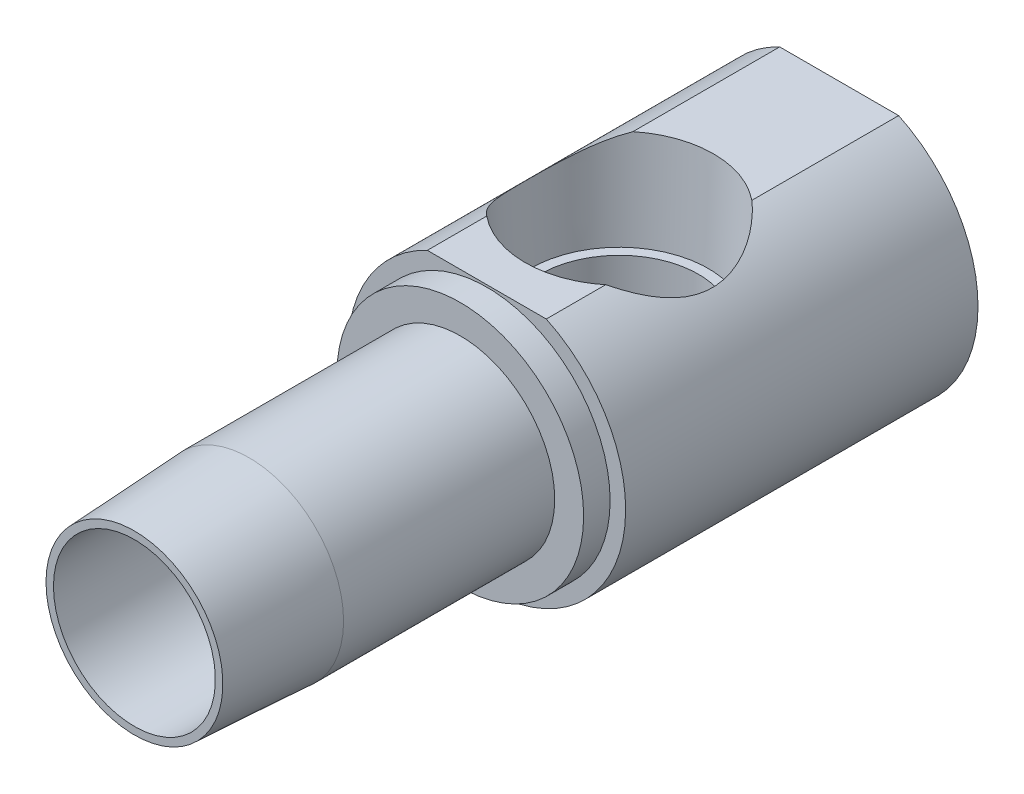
ISO-10303-21;
HEADER;
FILE_DESCRIPTION(('STEP AP214'),'2;1');
FILE_NAME('part.step','',(''),(''),'','','');
FILE_SCHEMA(('AUTOMOTIVE_DESIGN { 1 0 10303 214 1 1 1 1 }'));
ENDSEC;
DATA;
#1=APPLICATION_CONTEXT('core data for automotive mechanical design processes');
#2=APPLICATION_PROTOCOL_DEFINITION('international standard','automotive_design',2000,#1);
#3=PRODUCT_CONTEXT('',#1,'mechanical');
#4=PRODUCT('Part','Part','',(#3));
#5=PRODUCT_RELATED_PRODUCT_CATEGORY('part','',(#4));
#6=PRODUCT_DEFINITION_FORMATION('','',#4);
#7=PRODUCT_DEFINITION_CONTEXT('part definition',#1,'design');
#8=PRODUCT_DEFINITION('design','',#6,#7);
#9=PRODUCT_DEFINITION_SHAPE('','',#8);
#10=(LENGTH_UNIT() NAMED_UNIT(*) SI_UNIT(.MILLI.,.METRE.));
#11=(NAMED_UNIT(*) PLANE_ANGLE_UNIT() SI_UNIT($,.RADIAN.));
#12=(NAMED_UNIT(*) SI_UNIT($,.STERADIAN.) SOLID_ANGLE_UNIT());
#13=UNCERTAINTY_MEASURE_WITH_UNIT(LENGTH_MEASURE(1.E-05),#10,'distance_accuracy_value','');
#14=(GEOMETRIC_REPRESENTATION_CONTEXT(3) GLOBAL_UNCERTAINTY_ASSIGNED_CONTEXT((#13)) GLOBAL_UNIT_ASSIGNED_CONTEXT((#10,
#11,#12)) REPRESENTATION_CONTEXT('',''));
#15=CARTESIAN_POINT('',(0.,0.,0.));
#16=DIRECTION('',(0.,0.,1.));
#17=DIRECTION('',(1.,0.,0.));
#18=AXIS2_PLACEMENT_3D('',#15,#16,#17);
#19=CARTESIAN_POINT('',(-7.29488,0.,0.));
#20=DIRECTION('',(0.,0.,1.));
#21=DIRECTION('',(1.,0.,0.));
#22=AXIS2_PLACEMENT_3D('',#19,#20,#21);
#23=PLANE('',#22);
#24=CARTESIAN_POINT('',(0.,0.,0.));
#25=DIRECTION('',(0.,0.,-1.));
#26=DIRECTION('',(-1.,0.,0.));
#27=AXIS2_PLACEMENT_3D('',#24,#25,#26);
#28=CIRCLE('',#27,7.29488);
#29=CARTESIAN_POINT('',(-7.29488,0.,0.));
#30=VERTEX_POINT('',#29);
#31=EDGE_CURVE('E18',#30,#30,#28,.T.);
#32=ORIENTED_EDGE('',*,*,#31,.T.);
#33=EDGE_LOOP('',(#32));
#34=FACE_BOUND('',#33,.T.);
#35=CARTESIAN_POINT('',(0.,0.,0.));
#36=DIRECTION('',(0.,0.,-1.));
#37=DIRECTION('',(-1.,0.,0.));
#38=AXIS2_PLACEMENT_3D('',#35,#36,#37);
#39=CIRCLE('',#38,7.96721885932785);
#40=CARTESIAN_POINT('',(-7.96721885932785,0.,0.));
#41=VERTEX_POINT('',#40);
#42=EDGE_CURVE('E318',#41,#41,#39,.T.);
#43=ORIENTED_EDGE('',*,*,#42,.F.);
#44=EDGE_LOOP('',(#43));
#45=FACE_BOUND('',#44,.T.);
#46=ADVANCED_FACE('F15',(#34,#45),#23,.T.);
#47=CARTESIAN_POINT('',(0.,0.,-94.2471669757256));
#48=DIRECTION('',(0.,0.,-1.));
#49=DIRECTION('',(-1.,0.,0.));
#50=AXIS2_PLACEMENT_3D('',#47,#48,#49);
#51=CYLINDRICAL_SURFACE('',#50,8.509);
#52=CARTESIAN_POINT('',(0.,0.,-10.3378));
#53=DIRECTION('',(0.,0.,-1.));
#54=DIRECTION('',(-1.,0.,0.));
#55=AXIS2_PLACEMENT_3D('',#52,#53,#54);
#56=CIRCLE('',#55,8.509);
#57=CARTESIAN_POINT('',(-8.509,0.,-10.3378));
#58=VERTEX_POINT('',#57);
#59=EDGE_CURVE('E320',#58,#58,#56,.T.);
#60=ORIENTED_EDGE('',*,*,#59,.T.);
#61=EDGE_LOOP('',(#60));
#62=FACE_BOUND('',#61,.T.);
#63=CARTESIAN_POINT('',(0.,0.,-29.3624));
#64=DIRECTION('',(0.,0.,-1.));
#65=DIRECTION('',(-1.,0.,0.));
#66=AXIS2_PLACEMENT_3D('',#63,#64,#65);
#67=CIRCLE('',#66,8.509);
#68=CARTESIAN_POINT('',(-8.509,0.,-29.3624));
#69=VERTEX_POINT('',#68);
#70=EDGE_CURVE('E152',#69,#69,#67,.T.);
#71=ORIENTED_EDGE('',*,*,#70,.F.);
#72=EDGE_LOOP('',(#71));
#73=FACE_BOUND('',#72,.T.);
#74=ADVANCED_FACE('F226',(#62,#73),#51,.T.);
#75=CARTESIAN_POINT('',(-5.3594,11.3032925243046,-19.05));
#76=DIRECTION('',(0.,-1.,0.));
#77=DIRECTION('',(0.,0.,-1.));
#78=AXIS2_PLACEMENT_3D('',#75,#76,#77);
#79=PLANE('',#78);
#80=DIRECTION('',(0.,0.,-1.));
#81=VECTOR('',#80,1.);
#82=CARTESIAN_POINT('',(5.3594,11.3032925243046,-19.05));
#83=LINE('',#82,#81);
#84=CARTESIAN_POINT('',(5.3594,11.3032925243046,-31.75));
#85=VERTEX_POINT('',#84);
#86=CARTESIAN_POINT('',(5.3594,11.3032925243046,-37.10323946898));
#87=VERTEX_POINT('',#86);
#88=EDGE_CURVE('E136',#85,#87,#83,.T.);
#89=ORIENTED_EDGE('',*,*,#88,.T.);
#90=CARTESIAN_POINT('',(0.,11.3032925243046,-43.688));
#91=DIRECTION('',(0.,-1.,0.));
#92=DIRECTION('',(0.,0.,-1.));
#93=AXIS2_PLACEMENT_3D('',#90,#91,#92);
#94=CIRCLE('',#93,8.49012600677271);
#95=CARTESIAN_POINT('',(-5.3594,11.3032925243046,-37.10323946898));
#96=VERTEX_POINT('',#95);
#97=EDGE_CURVE('E122',#87,#96,#94,.T.);
#98=ORIENTED_EDGE('',*,*,#97,.T.);
#99=DIRECTION('',(0.,0.,-1.));
#100=VECTOR('',#99,1.);
#101=CARTESIAN_POINT('',(-5.3594,11.3032925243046,-19.05));
#102=LINE('',#101,#100);
#103=CARTESIAN_POINT('',(-5.3594,11.3032925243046,-31.75));
#104=VERTEX_POINT('',#103);
#105=EDGE_CURVE('E147',#104,#96,#102,.T.);
#106=ORIENTED_EDGE('',*,*,#105,.F.);
#107=DIRECTION('',(1.,0.,0.));
#108=VECTOR('',#107,1.);
#109=CARTESIAN_POINT('',(-11.1125,11.3032925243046,-31.75));
#110=LINE('',#109,#108);
#111=EDGE_CURVE('E144',#104,#85,#110,.T.);
#112=ORIENTED_EDGE('',*,*,#111,.T.);
#113=EDGE_LOOP('',(#89,#98,#106,#112));
#114=FACE_BOUND('',#113,.T.);
#115=ADVANCED_FACE('F142',(#114),#79,.F.);
#116=CARTESIAN_POINT('',(0.,0.,-94.2471669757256));
#117=DIRECTION('',(0.,0.,-1.));
#118=DIRECTION('',(-1.,0.,0.));
#119=AXIS2_PLACEMENT_3D('',#116,#117,#118);
#120=CYLINDRICAL_SURFACE('',#119,7.29488);
#121=ORIENTED_EDGE('',*,*,#31,.F.);
#122=EDGE_LOOP('',(#121));
#123=FACE_BOUND('',#122,.T.);
#124=CARTESIAN_POINT('',(0.,0.,-29.21));
#125=DIRECTION('',(0.,0.,-1.));
#126=DIRECTION('',(-1.,0.,0.));
#127=AXIS2_PLACEMENT_3D('',#124,#125,#126);
#128=CIRCLE('',#127,7.29488);
#129=CARTESIAN_POINT('',(-2.83926860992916,-6.71965981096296,-29.21));
#130=VERTEX_POINT('',#129);
#131=CARTESIAN_POINT('',(2.83926860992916,-6.71965981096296,-29.21));
#132=VERTEX_POINT('',#131);
#133=EDGE_CURVE('E166',#130,#132,#128,.T.);
#134=ORIENTED_EDGE('',*,*,#133,.T.);
#135=CARTESIAN_POINT('',(2.83926860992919,-6.71965981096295,-29.21));
#136=CARTESIAN_POINT('',(2.70908587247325,-6.77470567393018,-29.1520217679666));
#137=CARTESIAN_POINT('',(2.5754535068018,-6.82667201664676,-29.0989157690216));
#138=CARTESIAN_POINT('',(2.30236644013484,-6.92352687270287,-29.0021649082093));
#139=CARTESIAN_POINT('',(2.16291320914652,-6.96841715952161,-28.9585176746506));
#140=CARTESIAN_POINT('',(1.87942013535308,-7.05016472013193,-28.8804342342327));
#141=CARTESIAN_POINT('',(1.73538792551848,-7.08703463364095,-28.8459835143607));
#142=CARTESIAN_POINT('',(1.44358277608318,-7.1521803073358,-28.7859182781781));
#143=CARTESIAN_POINT('',(1.2958096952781,-7.18045574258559,-28.7603040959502));
#144=CARTESIAN_POINT('',(0.997667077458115,-7.22791200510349,-28.7176927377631));
#145=CARTESIAN_POINT('',(0.847298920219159,-7.2470975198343,-28.7006911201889));
#146=CARTESIAN_POINT('',(0.544945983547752,-7.27608226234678,-28.6751201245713));
#147=CARTESIAN_POINT('',(0.392961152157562,-7.28588118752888,-28.6665510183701));
#148=CARTESIAN_POINT('',(0.0883390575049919,-7.29593786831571,-28.6577574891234));
#149=CARTESIAN_POINT('',(-0.0642985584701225,-7.29618956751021,-28.6575383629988));
#150=CARTESIAN_POINT('',(-0.369068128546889,-7.28713276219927,-28.6654558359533));
#151=CARTESIAN_POINT('',(-0.521200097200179,-7.27782453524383,-28.6735921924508));
#152=CARTESIAN_POINT('',(-0.825795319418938,-7.24962203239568,-28.6984560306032));
#153=CARTESIAN_POINT('',(-0.97823901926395,-7.23060958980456,-28.7152894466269));
#154=CARTESIAN_POINT('',(-1.28042184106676,-7.18325692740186,-28.7577720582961));
#155=CARTESIAN_POINT('',(-1.43016107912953,-7.15491710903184,-28.7834208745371));
#156=CARTESIAN_POINT('',(-1.72558403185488,-7.0894631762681,-28.8437204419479));
#157=CARTESIAN_POINT('',(-1.87127414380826,-7.05236389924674,-28.8783559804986));
#158=CARTESIAN_POINT('',(-2.15770494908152,-6.97006186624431,-28.9569252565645));
#159=CARTESIAN_POINT('',(-2.29844851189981,-6.92486390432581,-29.0008534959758));
#160=CARTESIAN_POINT('',(-2.50498218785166,-6.85169148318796,-29.073911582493));
#161=CARTESIAN_POINT('',(-2.57303323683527,-6.82641747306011,-29.099445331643));
#162=CARTESIAN_POINT('',(-2.70743134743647,-6.77423657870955,-29.1529103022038));
#163=CARTESIAN_POINT('',(-2.77378053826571,-6.74733189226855,-29.1808383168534));
#164=CARTESIAN_POINT('',(-2.83926860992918,-6.7196598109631,-29.21));
#165=B_SPLINE_CURVE_WITH_KNOTS('',3,(#135,#136,#137,#138,#139,#140,#141,#142,#143,#144,#145,
#146,#147,#148,#149,#150,#151,#152,#153,#154,#155,#156,#157,#158,#159,#160,#161,#162,#163,#164),
.UNSPECIFIED.,.F.,.F.,(4,2,2,2,2,2,2,2,2,2,2,2,2,2,4),(0.,0.458141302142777,0.91616759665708,
1.37346674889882,1.83078318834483,2.28786354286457,2.74495863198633,3.20234368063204,
3.65971545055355,4.12279436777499,4.58585335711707,5.04813354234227,5.51014097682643,
5.74093493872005,5.97142447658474),.UNSPECIFIED.);
#166=EDGE_CURVE('E228',#132,#130,#165,.T.);
#167=ORIENTED_EDGE('',*,*,#166,.T.);
#168=EDGE_LOOP('',(#134,#167));
#169=FACE_BOUND('',#168,.T.);
#170=ADVANCED_FACE('F221',(#123,#169),#120,.F.);
#171=CARTESIAN_POINT('',(-7.29488,0.,-29.21));
#172=DIRECTION('',(0.,0.,1.));
#173=DIRECTION('',(1.,0.,0.));
#174=AXIS2_PLACEMENT_3D('',#171,#172,#173);
#175=PLANE('',#174);
#176=ORIENTED_EDGE('',*,*,#133,.F.);
#177=CARTESIAN_POINT('',(0.,-0.996470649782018,-29.21));
#178=DIRECTION('',(0.,0.,1.));
#179=DIRECTION('',(0.,-1.,0.));
#180=AXIS2_PLACEMENT_3D('',#177,#178,#179);
#181=ELLIPSE('',#180,6.41876281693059,6.27107494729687);
#182=EDGE_CURVE('E170',#130,#132,#181,.F.);
#183=ORIENTED_EDGE('',*,*,#182,.T.);
#184=EDGE_LOOP('',(#176,#183));
#185=FACE_BOUND('',#184,.T.);
#186=ADVANCED_FACE('F217',(#185),#175,.T.);
#187=CARTESIAN_POINT('',(-12.5095,0.,-63.5));
#188=DIRECTION('',(0.,0.,-1.));
#189=DIRECTION('',(-1.,0.,0.));
#190=AXIS2_PLACEMENT_3D('',#187,#188,#189);
#191=PLANE('',#190);
#192=DIRECTION('',(1.,0.,0.));
#193=VECTOR('',#192,1.);
#194=CARTESIAN_POINT('',(-3.66617420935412,6.35,-63.5));
#195=LINE('',#194,#193);
#196=CARTESIAN_POINT('',(-3.66617420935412,6.35,-63.5));
#197=VERTEX_POINT('',#196);
#198=CARTESIAN_POINT('',(3.66617420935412,6.35,-63.5));
#199=VERTEX_POINT('',#198);
#200=EDGE_CURVE('E235',#197,#199,#195,.T.);
#201=ORIENTED_EDGE('',*,*,#200,.F.);
#202=DIRECTION('',(0.5,0.866025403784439,0.));
#203=VECTOR('',#202,1.);
#204=CARTESIAN_POINT('',(-7.33234841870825,0.,-63.5));
#205=LINE('',#204,#203);
#206=CARTESIAN_POINT('',(-7.33234841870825,0.,-63.5));
#207=VERTEX_POINT('',#206);
#208=EDGE_CURVE('E242',#207,#197,#205,.T.);
#209=ORIENTED_EDGE('',*,*,#208,.F.);
#210=DIRECTION('',(-0.5,0.866025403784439,0.));
#211=VECTOR('',#210,1.);
#212=CARTESIAN_POINT('',(-3.66617420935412,-6.35,-63.5));
#213=LINE('',#212,#211);
#214=CARTESIAN_POINT('',(-3.66617420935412,-6.35,-63.5));
#215=VERTEX_POINT('',#214);
#216=EDGE_CURVE('E268',#215,#207,#213,.T.);
#217=ORIENTED_EDGE('',*,*,#216,.F.);
#218=DIRECTION('',(-1.,0.,0.));
#219=VECTOR('',#218,1.);
#220=CARTESIAN_POINT('',(3.66617420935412,-6.35,-63.5));
#221=LINE('',#220,#219);
#222=CARTESIAN_POINT('',(3.66617420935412,-6.35,-63.5));
#223=VERTEX_POINT('',#222);
#224=EDGE_CURVE('E265',#223,#215,#221,.T.);
#225=ORIENTED_EDGE('',*,*,#224,.F.);
#226=DIRECTION('',(-0.5,-0.866025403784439,0.));
#227=VECTOR('',#226,1.);
#228=CARTESIAN_POINT('',(7.33234841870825,0.,-63.5));
#229=LINE('',#228,#227);
#230=CARTESIAN_POINT('',(7.33234841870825,0.,-63.5));
#231=VERTEX_POINT('',#230);
#232=EDGE_CURVE('E262',#231,#223,#229,.T.);
#233=ORIENTED_EDGE('',*,*,#232,.F.);
#234=DIRECTION('',(0.5,-0.866025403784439,0.));
#235=VECTOR('',#234,1.);
#236=CARTESIAN_POINT('',(3.66617420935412,6.35,-63.5));
#237=LINE('',#236,#235);
#238=EDGE_CURVE('E259',#199,#231,#237,.T.);
#239=ORIENTED_EDGE('',*,*,#238,.F.);
#240=EDGE_LOOP('',(#201,#209,#217,#225,#233,#239));
#241=FACE_BOUND('',#240,.T.);
#242=DIRECTION('',(-1.,0.,0.));
#243=VECTOR('',#242,1.);
#244=CARTESIAN_POINT('',(-5.3594,11.3032925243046,-63.5));
#245=LINE('',#244,#243);
#246=CARTESIAN_POINT('',(5.3594,11.3032925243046,-63.5));
#247=VERTEX_POINT('',#246);
#248=CARTESIAN_POINT('',(-5.3594,11.3032925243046,-63.5));
#249=VERTEX_POINT('',#248);
#250=EDGE_CURVE('E149',#247,#249,#245,.T.);
#251=ORIENTED_EDGE('',*,*,#250,.F.);
#252=CARTESIAN_POINT('',(0.,0.,-63.5));
#253=DIRECTION('',(0.,0.,-1.));
#254=DIRECTION('',(-1.,0.,0.));
#255=AXIS2_PLACEMENT_3D('',#252,#253,#254);
#256=CIRCLE('',#255,12.5095);
#257=EDGE_CURVE('E163',#247,#249,#256,.T.);
#258=ORIENTED_EDGE('',*,*,#257,.T.);
#259=EDGE_LOOP('',(#251,#258));
#260=FACE_BOUND('',#259,.T.);
#261=ADVANCED_FACE('F212',(#241,#260),#191,.T.);
#262=CARTESIAN_POINT('',(0.,0.,-94.2471669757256));
#263=DIRECTION('',(0.,0.,-1.));
#264=DIRECTION('',(-1.,0.,0.));
#265=AXIS2_PLACEMENT_3D('',#262,#263,#264);
#266=CYLINDRICAL_SURFACE('',#265,12.5095);
#267=CARTESIAN_POINT('',(5.3589781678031,11.3034925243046,-37.1028826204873));
#268=CARTESIAN_POINT('',(5.5492136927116,11.2133234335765,-37.2638407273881));
#269=CARTESIAN_POINT('',(5.73165431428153,11.1209258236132,-37.432665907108));
#270=CARTESIAN_POINT('',(6.08048620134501,10.9340894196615,-37.7852208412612));
#271=CARTESIAN_POINT('',(6.24687354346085,10.8396501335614,-37.9689542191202));
#272=CARTESIAN_POINT('',(6.56420314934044,10.6505028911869,-38.3518126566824));
#273=CARTESIAN_POINT('',(6.71502345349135,10.5557980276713,-38.5510405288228));
#274=CARTESIAN_POINT('',(6.99914257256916,10.3695935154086,-38.9628637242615));
#275=CARTESIAN_POINT('',(7.1324444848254,10.2780933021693,-39.1754566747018));
#276=CARTESIAN_POINT('',(7.46650834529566,10.0401700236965,-39.7646742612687));
#277=CARTESIAN_POINT('',(7.65054804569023,9.89929381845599,-40.1534819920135));
#278=CARTESIAN_POINT('',(7.88323238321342,9.71350267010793,-40.7599632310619));
#279=CARTESIAN_POINT('',(7.95350713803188,9.65587918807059,-40.9657452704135));
#280=CARTESIAN_POINT('',(8.07900681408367,9.55112103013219,-41.384515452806));
#281=CARTESIAN_POINT('',(8.1342346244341,9.50398434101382,-41.5975022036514));
#282=CARTESIAN_POINT('',(8.22106638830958,9.42891275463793,-41.994107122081));
#283=CARTESIAN_POINT('',(8.25505388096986,9.39910020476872,-42.1768521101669));
#284=CARTESIAN_POINT('',(8.31144289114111,9.34927427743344,-42.5454304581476));
#285=CARTESIAN_POINT('',(8.33384667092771,9.32925898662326,-42.7312632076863));
#286=CARTESIAN_POINT('',(8.36672861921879,9.29978140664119,-43.1047275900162));
#287=CARTESIAN_POINT('',(8.37721265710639,9.29031392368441,-43.2923582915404));
#288=CARTESIAN_POINT('',(8.3861052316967,9.28228778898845,-43.6681465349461));
#289=CARTESIAN_POINT('',(8.38451351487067,9.28372936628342,-43.8563040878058));
#290=CARTESIAN_POINT('',(8.36928475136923,9.29746017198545,-44.2316139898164));
#291=CARTESIAN_POINT('',(8.35565497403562,9.30974285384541,-44.4187668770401));
#292=CARTESIAN_POINT('',(8.3165791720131,9.3446659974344,-44.790843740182));
#293=CARTESIAN_POINT('',(8.2911332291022,9.36730638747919,-44.975767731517));
#294=CARTESIAN_POINT('',(8.22876601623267,9.42213985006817,-45.342394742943));
#295=CARTESIAN_POINT('',(8.19183425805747,9.454341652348,-45.5240946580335));
#296=CARTESIAN_POINT('',(8.10694730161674,9.52723048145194,-45.8832473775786));
#297=CARTESIAN_POINT('',(8.0589858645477,9.56792230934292,-46.0606977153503));
#298=CARTESIAN_POINT('',(7.93720028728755,9.66935365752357,-46.4609579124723));
#299=CARTESIAN_POINT('',(7.85990590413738,9.73249157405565,-46.6821095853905));
#300=CARTESIAN_POINT('',(7.68886075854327,9.86817719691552,-47.1149768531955));
#301=CARTESIAN_POINT('',(7.59510436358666,9.940728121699,-47.326689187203));
#302=CARTESIAN_POINT('',(7.39186656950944,10.092770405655,-47.7402308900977));
#303=CARTESIAN_POINT('',(7.28236248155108,10.172271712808,-47.9420454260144));
#304=CARTESIAN_POINT('',(7.04849385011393,10.3357003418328,-48.3348508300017));
#305=CARTESIAN_POINT('',(6.92413202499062,10.4196268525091,-48.5258436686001));
#306=CARTESIAN_POINT('',(6.58695562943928,10.637641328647,-49.0010218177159));
#307=CARTESIAN_POINT('',(6.36373226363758,10.7733928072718,-49.2772036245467));
#308=CARTESIAN_POINT('',(6.00459360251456,10.9750283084,-49.6684604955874));
#309=CARTESIAN_POINT('',(5.88113847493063,11.0417585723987,-49.7947819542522));
#310=CARTESIAN_POINT('',(5.62611191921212,11.1738564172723,-50.0397690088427));
#311=CARTESIAN_POINT('',(5.49453878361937,11.2392237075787,-50.1584329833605));
#312=CARTESIAN_POINT('',(5.3589781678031,11.3034925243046,-50.2731173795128));
#313=B_SPLINE_CURVE_WITH_KNOTS('',3,(#267,#268,#269,#270,#271,#272,#273,#274,#275,#276,#277,
#278,#279,#280,#281,#282,#283,#284,#285,#286,#287,#288,#289,#290,#291,#292,#293,#294,#295,#296,
#297,#298,#299,#300,#301,#302,#303,#304,#305,#306,#307,#308,#309,#310,#311,#312),.UNSPECIFIED.,
.F.,.F.,(4,2,2,2,2,2,2,2,2,2,2,2,2,2,2,2,2,2,2,2,2,2,4),(0.,0.794684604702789,1.58956293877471,
2.39025916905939,3.19081364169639,4.54240556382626,5.21661127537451,5.89068744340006,
6.45486541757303,7.01893316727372,7.58272304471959,8.14652475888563,8.70998624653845,
9.27344383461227,9.8374174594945,10.4017108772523,11.1285534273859,11.8556451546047,
12.5837951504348,13.3118121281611,14.449296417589,15.0154674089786,15.5817578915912),.UNSPECIFIED.);
#314=CARTESIAN_POINT('',(5.3594,11.3032925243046,-50.27276053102));
#315=VERTEX_POINT('',#314);
#316=EDGE_CURVE('E30',#87,#315,#313,.T.);
#317=ORIENTED_EDGE('',*,*,#316,.F.);
#318=ORIENTED_EDGE('',*,*,#88,.F.);
#319=CARTESIAN_POINT('',(0.,0.,-31.75));
#320=DIRECTION('',(0.,0.,-1.));
#321=DIRECTION('',(-1.,0.,0.));
#322=AXIS2_PLACEMENT_3D('',#319,#320,#321);
#323=CIRCLE('',#322,12.5095);
#324=EDGE_CURVE('E161',#85,#104,#323,.T.);
#325=ORIENTED_EDGE('',*,*,#324,.T.);
#326=ORIENTED_EDGE('',*,*,#105,.T.);
#327=CARTESIAN_POINT('',(-5.3589781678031,11.3034925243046,-50.2731173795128));
#328=CARTESIAN_POINT('',(-5.54921369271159,11.2133234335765,-50.1121592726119));
#329=CARTESIAN_POINT('',(-5.73165431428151,11.1209258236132,-49.943334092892));
#330=CARTESIAN_POINT('',(-6.08048620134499,10.9340894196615,-49.5907791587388));
#331=CARTESIAN_POINT('',(-6.24687354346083,10.8396501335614,-49.4070457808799));
#332=CARTESIAN_POINT('',(-6.56420314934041,10.650502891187,-49.0241873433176));
#333=CARTESIAN_POINT('',(-6.71502345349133,10.5557980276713,-48.8249594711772));
#334=CARTESIAN_POINT('',(-6.99914257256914,10.3695935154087,-48.4131362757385));
#335=CARTESIAN_POINT('',(-7.13244448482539,10.2780933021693,-48.2005433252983));
#336=CARTESIAN_POINT('',(-7.46650834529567,10.0401700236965,-47.6113257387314));
#337=CARTESIAN_POINT('',(-7.65054804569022,9.899293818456,-47.2225180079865));
#338=CARTESIAN_POINT('',(-7.8832323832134,9.71350267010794,-46.6160367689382));
#339=CARTESIAN_POINT('',(-7.95350713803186,9.65587918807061,-46.4102547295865));
#340=CARTESIAN_POINT('',(-8.07900681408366,9.5511210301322,-45.991484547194));
#341=CARTESIAN_POINT('',(-8.1342346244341,9.50398434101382,-45.7784977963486));
#342=CARTESIAN_POINT('',(-8.22106638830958,9.42891275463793,-45.381892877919));
#343=CARTESIAN_POINT('',(-8.25505388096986,9.39910020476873,-45.1991478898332));
#344=CARTESIAN_POINT('',(-8.3114428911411,9.34927427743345,-44.8305695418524));
#345=CARTESIAN_POINT('',(-8.3338466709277,9.32925898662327,-44.6447367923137));
#346=CARTESIAN_POINT('',(-8.36672861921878,9.29978140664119,-44.2712724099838));
#347=CARTESIAN_POINT('',(-8.37721265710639,9.29031392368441,-44.0836417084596));
#348=CARTESIAN_POINT('',(-8.3861052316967,9.28228778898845,-43.707853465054));
#349=CARTESIAN_POINT('',(-8.38451351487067,9.28372936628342,-43.5196959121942));
#350=CARTESIAN_POINT('',(-8.36928475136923,9.29746017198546,-43.1443860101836));
#351=CARTESIAN_POINT('',(-8.35565497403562,9.30974285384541,-42.9572331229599));
#352=CARTESIAN_POINT('',(-8.3165791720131,9.3446659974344,-42.5851562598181));
#353=CARTESIAN_POINT('',(-8.2911332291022,9.36730638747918,-42.4002322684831));
#354=CARTESIAN_POINT('',(-8.22876601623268,9.42213985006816,-42.033605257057));
#355=CARTESIAN_POINT('',(-8.19183425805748,9.45434165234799,-41.8519053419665));
#356=CARTESIAN_POINT('',(-8.10694730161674,9.52723048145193,-41.4927526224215));
#357=CARTESIAN_POINT('',(-8.0589858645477,9.56792230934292,-41.3153022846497));
#358=CARTESIAN_POINT('',(-7.93720028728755,9.66935365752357,-40.9150420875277));
#359=CARTESIAN_POINT('',(-7.85990590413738,9.73249157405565,-40.6938904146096));
#360=CARTESIAN_POINT('',(-7.68886075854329,9.86817719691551,-40.2610231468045));
#361=CARTESIAN_POINT('',(-7.59510436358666,9.940728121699,-40.0493108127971));
#362=CARTESIAN_POINT('',(-7.39186656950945,10.0927704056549,-39.6357691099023));
#363=CARTESIAN_POINT('',(-7.28236248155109,10.172271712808,-39.4339545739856));
#364=CARTESIAN_POINT('',(-7.04849385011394,10.3357003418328,-39.0411491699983));
#365=CARTESIAN_POINT('',(-6.92413202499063,10.4196268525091,-38.8501563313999));
#366=CARTESIAN_POINT('',(-6.58695562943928,10.637641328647,-38.3749781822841));
#367=CARTESIAN_POINT('',(-6.36373226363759,10.7733928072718,-38.0987963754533));
#368=CARTESIAN_POINT('',(-6.00459360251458,10.9750283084,-37.7075395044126));
#369=CARTESIAN_POINT('',(-5.88113847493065,11.0417585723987,-37.5812180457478));
#370=CARTESIAN_POINT('',(-5.62611191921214,11.1738564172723,-37.3362309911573));
#371=CARTESIAN_POINT('',(-5.49453878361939,11.2392237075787,-37.2175670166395));
#372=CARTESIAN_POINT('',(-5.3589781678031,11.3034925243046,-37.1028826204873));
#373=B_SPLINE_CURVE_WITH_KNOTS('',3,(#327,#328,#329,#330,#331,#332,#333,#334,#335,#336,#337,
#338,#339,#340,#341,#342,#343,#344,#345,#346,#347,#348,#349,#350,#351,#352,#353,#354,#355,#356,
#357,#358,#359,#360,#361,#362,#363,#364,#365,#366,#367,#368,#369,#370,#371,#372),.UNSPECIFIED.,
.F.,.F.,(4,2,2,2,2,2,2,2,2,2,2,2,2,2,2,2,2,2,2,2,2,2,4),(0.,0.794684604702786,1.58956293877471,
2.39025916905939,3.19081364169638,4.54240556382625,5.2166112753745,5.89068744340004,
6.45486541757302,7.01893316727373,7.5827230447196,8.14652475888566,8.70998624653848,
9.27344383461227,9.83741745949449,10.4017108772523,11.1285534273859,11.8556451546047,
12.5837951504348,13.3118121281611,14.449296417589,15.0154674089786,15.5817578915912),.UNSPECIFIED.);
#374=CARTESIAN_POINT('',(-5.3594,11.3032925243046,-50.27276053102));
#375=VERTEX_POINT('',#374);
#376=EDGE_CURVE('E125',#375,#96,#373,.T.);
#377=ORIENTED_EDGE('',*,*,#376,.F.);
#378=EDGE_CURVE('E145',#375,#249,#102,.T.);
#379=ORIENTED_EDGE('',*,*,#378,.T.);
#380=ORIENTED_EDGE('',*,*,#257,.F.);
#381=EDGE_CURVE('E139',#315,#247,#83,.T.);
#382=ORIENTED_EDGE('',*,*,#381,.F.);
#383=EDGE_LOOP('',(#317,#318,#325,#326,#377,#379,#380,#382));
#384=FACE_BOUND('',#383,.T.);
#385=ADVANCED_FACE('F134',(#384),#266,.T.);
#386=CARTESIAN_POINT('',(-11.1125,0.,-31.75));
#387=DIRECTION('',(0.,0.,1.));
#388=DIRECTION('',(1.,0.,0.));
#389=AXIS2_PLACEMENT_3D('',#386,#387,#388);
#390=PLANE('',#389);
#391=ORIENTED_EDGE('',*,*,#111,.F.);
#392=ORIENTED_EDGE('',*,*,#324,.F.);
#393=EDGE_LOOP('',(#391,#392));
#394=FACE_BOUND('',#393,.T.);
#395=CARTESIAN_POINT('',(0.,0.,-31.75));
#396=DIRECTION('',(0.,0.,-1.));
#397=DIRECTION('',(-1.,0.,0.));
#398=AXIS2_PLACEMENT_3D('',#395,#396,#397);
#399=CIRCLE('',#398,11.1125);
#400=CARTESIAN_POINT('',(-11.1125,0.,-31.75));
#401=VERTEX_POINT('',#400);
#402=EDGE_CURVE('E158',#401,#401,#399,.T.);
#403=ORIENTED_EDGE('',*,*,#402,.T.);
#404=EDGE_LOOP('',(#403));
#405=FACE_BOUND('',#404,.T.);
#406=ADVANCED_FACE('F211',(#394,#405),#390,.T.);
#407=CARTESIAN_POINT('',(0.,0.,-94.2471669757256));
#408=DIRECTION('',(0.,0.,-1.));
#409=DIRECTION('',(-1.,0.,0.));
#410=AXIS2_PLACEMENT_3D('',#407,#408,#409);
#411=CYLINDRICAL_SURFACE('',#410,11.1125);
#412=CARTESIAN_POINT('',(0.,0.,-29.3624));
#413=DIRECTION('',(0.,0.,-1.));
#414=DIRECTION('',(-1.,0.,0.));
#415=AXIS2_PLACEMENT_3D('',#412,#413,#414);
#416=CIRCLE('',#415,11.1125);
#417=CARTESIAN_POINT('',(-11.1125,0.,-29.3624));
#418=VERTEX_POINT('',#417);
#419=EDGE_CURVE('E155',#418,#418,#416,.T.);
#420=ORIENTED_EDGE('',*,*,#419,.T.);
#421=EDGE_LOOP('',(#420));
#422=FACE_BOUND('',#421,.T.);
#423=ORIENTED_EDGE('',*,*,#402,.F.);
#424=EDGE_LOOP('',(#423));
#425=FACE_BOUND('',#424,.T.);
#426=ADVANCED_FACE('F293',(#422,#425),#411,.T.);
#427=CARTESIAN_POINT('',(-8.509,0.,-29.3624));
#428=DIRECTION('',(0.,0.,1.));
#429=DIRECTION('',(1.,0.,0.));
#430=AXIS2_PLACEMENT_3D('',#427,#428,#429);
#431=PLANE('',#430);
#432=ORIENTED_EDGE('',*,*,#70,.T.);
#433=EDGE_LOOP('',(#432));
#434=FACE_BOUND('',#433,.T.);
#435=ORIENTED_EDGE('',*,*,#419,.F.);
#436=EDGE_LOOP('',(#435));
#437=FACE_BOUND('',#436,.T.);
#438=ADVANCED_FACE('F297',(#434,#437),#431,.T.);
#439=ORIENTED_EDGE('',*,*,#378,.F.);
#440=EDGE_CURVE('E129',#375,#315,#94,.T.);
#441=ORIENTED_EDGE('',*,*,#440,.T.);
#442=ORIENTED_EDGE('',*,*,#381,.T.);
#443=ORIENTED_EDGE('',*,*,#250,.T.);
#444=EDGE_LOOP('',(#439,#441,#442,#443));
#445=FACE_BOUND('',#444,.T.);
#446=ADVANCED_FACE('F288',(#445),#79,.F.);
#447=CARTESIAN_POINT('',(-3.66617420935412,6.35,-57.15));
#448=DIRECTION('',(0.,1.,0.));
#449=DIRECTION('',(-1.,0.,0.));
#450=AXIS2_PLACEMENT_3D('',#447,#448,#449);
#451=PLANE('',#450);
#452=ORIENTED_EDGE('',*,*,#200,.T.);
#453=DIRECTION('',(0.,0.,-1.));
#454=VECTOR('',#453,1.);
#455=CARTESIAN_POINT('',(3.66617420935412,6.35,-57.15));
#456=LINE('',#455,#454);
#457=CARTESIAN_POINT('',(3.66617420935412,6.35,-57.15));
#458=VERTEX_POINT('',#457);
#459=EDGE_CURVE('E257',#458,#199,#456,.T.);
#460=ORIENTED_EDGE('',*,*,#459,.F.);
#461=DIRECTION('',(1.,0.,0.));
#462=VECTOR('',#461,1.);
#463=CARTESIAN_POINT('',(-3.66617420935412,6.35,-57.15));
#464=LINE('',#463,#462);
#465=CARTESIAN_POINT('',(-3.66617420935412,6.35,-57.15));
#466=VERTEX_POINT('',#465);
#467=EDGE_CURVE('E238',#466,#458,#464,.T.);
#468=ORIENTED_EDGE('',*,*,#467,.F.);
#469=DIRECTION('',(0.,0.,-1.));
#470=VECTOR('',#469,1.);
#471=CARTESIAN_POINT('',(-3.66617420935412,6.35,-57.15));
#472=LINE('',#471,#470);
#473=EDGE_CURVE('E273',#466,#197,#472,.T.);
#474=ORIENTED_EDGE('',*,*,#473,.T.);
#475=EDGE_LOOP('',(#452,#460,#468,#474));
#476=FACE_BOUND('',#475,.T.);
#477=ADVANCED_FACE('F392',(#476),#451,.F.);
#478=CARTESIAN_POINT('',(-7.33234841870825,0.,-57.15));
#479=DIRECTION('',(-0.866025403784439,0.5,0.));
#480=DIRECTION('',(-0.5,-0.866025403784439,0.));
#481=AXIS2_PLACEMENT_3D('',#478,#479,#480);
#482=PLANE('',#481);
#483=ORIENTED_EDGE('',*,*,#208,.T.);
#484=ORIENTED_EDGE('',*,*,#473,.F.);
#485=DIRECTION('',(0.5,0.866025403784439,0.));
#486=VECTOR('',#485,1.);
#487=CARTESIAN_POINT('',(-7.33234841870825,0.,-57.15));
#488=LINE('',#487,#486);
#489=CARTESIAN_POINT('',(-7.33234841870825,0.,-57.15));
#490=VERTEX_POINT('',#489);
#491=EDGE_CURVE('E254',#490,#466,#488,.T.);
#492=ORIENTED_EDGE('',*,*,#491,.F.);
#493=DIRECTION('',(0.,0.,-1.));
#494=VECTOR('',#493,1.);
#495=CARTESIAN_POINT('',(-7.33234841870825,0.,-57.15));
#496=LINE('',#495,#494);
#497=EDGE_CURVE('E275',#490,#207,#496,.T.);
#498=ORIENTED_EDGE('',*,*,#497,.T.);
#499=EDGE_LOOP('',(#483,#484,#492,#498));
#500=FACE_BOUND('',#499,.T.);
#501=ADVANCED_FACE('F388',(#500),#482,.F.);
#502=CARTESIAN_POINT('',(-3.66617420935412,-6.35,-57.15));
#503=DIRECTION('',(-0.866025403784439,-0.5,0.));
#504=DIRECTION('',(0.5,-0.866025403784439,0.));
#505=AXIS2_PLACEMENT_3D('',#502,#503,#504);
#506=PLANE('',#505);
#507=ORIENTED_EDGE('',*,*,#216,.T.);
#508=ORIENTED_EDGE('',*,*,#497,.F.);
#509=DIRECTION('',(-0.5,0.866025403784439,0.));
#510=VECTOR('',#509,1.);
#511=CARTESIAN_POINT('',(-3.66617420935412,-6.35,-57.15));
#512=LINE('',#511,#510);
#513=CARTESIAN_POINT('',(-3.66617420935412,-6.35,-57.15));
#514=VERTEX_POINT('',#513);
#515=EDGE_CURVE('E251',#514,#490,#512,.T.);
#516=ORIENTED_EDGE('',*,*,#515,.F.);
#517=DIRECTION('',(0.,0.,-1.));
#518=VECTOR('',#517,1.);
#519=CARTESIAN_POINT('',(-3.66617420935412,-6.35,-57.15));
#520=LINE('',#519,#518);
#521=EDGE_CURVE('E277',#514,#215,#520,.T.);
#522=ORIENTED_EDGE('',*,*,#521,.T.);
#523=EDGE_LOOP('',(#507,#508,#516,#522));
#524=FACE_BOUND('',#523,.T.);
#525=ADVANCED_FACE('F391',(#524),#506,.F.);
#526=CARTESIAN_POINT('',(3.66617420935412,-6.35,-57.15));
#527=DIRECTION('',(0.,-1.,0.));
#528=DIRECTION('',(1.,0.,0.));
#529=AXIS2_PLACEMENT_3D('',#526,#527,#528);
#530=PLANE('',#529);
#531=ORIENTED_EDGE('',*,*,#224,.T.);
#532=ORIENTED_EDGE('',*,*,#521,.F.);
#533=DIRECTION('',(-1.,0.,0.));
#534=VECTOR('',#533,1.);
#535=CARTESIAN_POINT('',(3.66617420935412,-6.35,-57.15));
#536=LINE('',#535,#534);
#537=CARTESIAN_POINT('',(3.66617420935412,-6.35,-57.15));
#538=VERTEX_POINT('',#537);
#539=EDGE_CURVE('E248',#538,#514,#536,.T.);
#540=ORIENTED_EDGE('',*,*,#539,.F.);
#541=DIRECTION('',(0.,0.,-1.));
#542=VECTOR('',#541,1.);
#543=CARTESIAN_POINT('',(3.66617420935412,-6.35,-57.15));
#544=LINE('',#543,#542);
#545=EDGE_CURVE('E279',#538,#223,#544,.T.);
#546=ORIENTED_EDGE('',*,*,#545,.T.);
#547=EDGE_LOOP('',(#531,#532,#540,#546));
#548=FACE_BOUND('',#547,.T.);
#549=ADVANCED_FACE('F396',(#548),#530,.F.);
#550=CARTESIAN_POINT('',(7.33234841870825,0.,-57.15));
#551=DIRECTION('',(0.866025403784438,-0.5,0.));
#552=DIRECTION('',(0.5,0.866025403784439,0.));
#553=AXIS2_PLACEMENT_3D('',#550,#551,#552);
#554=PLANE('',#553);
#555=ORIENTED_EDGE('',*,*,#232,.T.);
#556=ORIENTED_EDGE('',*,*,#545,.F.);
#557=DIRECTION('',(-0.5,-0.866025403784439,0.));
#558=VECTOR('',#557,1.);
#559=CARTESIAN_POINT('',(7.33234841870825,0.,-57.15));
#560=LINE('',#559,#558);
#561=CARTESIAN_POINT('',(7.33234841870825,0.,-57.15));
#562=VERTEX_POINT('',#561);
#563=EDGE_CURVE('E245',#562,#538,#560,.T.);
#564=ORIENTED_EDGE('',*,*,#563,.F.);
#565=DIRECTION('',(0.,0.,-1.));
#566=VECTOR('',#565,1.);
#567=CARTESIAN_POINT('',(7.33234841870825,0.,-57.15));
#568=LINE('',#567,#566);
#569=EDGE_CURVE('E281',#562,#231,#568,.T.);
#570=ORIENTED_EDGE('',*,*,#569,.T.);
#571=EDGE_LOOP('',(#555,#556,#564,#570));
#572=FACE_BOUND('',#571,.T.);
#573=ADVANCED_FACE('F400',(#572),#554,.F.);
#574=CARTESIAN_POINT('',(3.66617420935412,6.35,-57.15));
#575=DIRECTION('',(0.866025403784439,0.5,0.));
#576=DIRECTION('',(-0.5,0.866025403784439,0.));
#577=AXIS2_PLACEMENT_3D('',#574,#575,#576);
#578=PLANE('',#577);
#579=ORIENTED_EDGE('',*,*,#238,.T.);
#580=ORIENTED_EDGE('',*,*,#569,.F.);
#581=DIRECTION('',(0.5,-0.866025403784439,0.));
#582=VECTOR('',#581,1.);
#583=CARTESIAN_POINT('',(3.66617420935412,6.35,-57.15));
#584=LINE('',#583,#582);
#585=EDGE_CURVE('E241',#458,#562,#584,.T.);
#586=ORIENTED_EDGE('',*,*,#585,.F.);
#587=ORIENTED_EDGE('',*,*,#459,.T.);
#588=EDGE_LOOP('',(#579,#580,#586,#587));
#589=FACE_BOUND('',#588,.T.);
#590=ADVANCED_FACE('F386',(#589),#578,.F.);
#591=CARTESIAN_POINT('',(0.,0.,-57.15));
#592=DIRECTION('',(0.,0.,-1.));
#593=DIRECTION('',(-1.,0.,0.));
#594=AXIS2_PLACEMENT_3D('',#591,#592,#593);
#595=PLANE('',#594);
#596=ORIENTED_EDGE('',*,*,#467,.T.);
#597=ORIENTED_EDGE('',*,*,#585,.T.);
#598=ORIENTED_EDGE('',*,*,#563,.T.);
#599=ORIENTED_EDGE('',*,*,#539,.T.);
#600=ORIENTED_EDGE('',*,*,#515,.T.);
#601=ORIENTED_EDGE('',*,*,#491,.T.);
#602=EDGE_LOOP('',(#596,#597,#598,#599,#600,#601));
#603=FACE_BOUND('',#602,.T.);
#604=ADVANCED_FACE('F381',(#603),#595,.T.);
#605=CARTESIAN_POINT('',(0.,-4.02688128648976,-43.091711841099));
#606=DIRECTION('',(0.,0.213279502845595,0.976991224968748));
#607=DIRECTION('',(0.,-0.976991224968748,0.213279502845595));
#608=AXIS2_PLACEMENT_3D('',#605,#606,#607);
#609=CONICAL_SURFACE('',#608,6.27107494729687,0.738529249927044);
#610=CARTESIAN_POINT('',(0.,-7.8171617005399,-45.8011650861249));
#611=CARTESIAN_POINT('',(0.0306488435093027,-7.81716198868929,-45.8011654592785));
#612=CARTESIAN_POINT('',(0.0612977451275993,-7.81694149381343,-45.8008798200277));
#613=CARTESIAN_POINT('',(0.129766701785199,-7.81595747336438,-45.799605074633));
#614=CARTESIAN_POINT('',(0.167582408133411,-7.81507869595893,-45.7984666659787));
#615=CARTESIAN_POINT('',(0.243722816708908,-7.81263621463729,-45.795302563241));
#616=CARTESIAN_POINT('',(0.282046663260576,-7.81106245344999,-45.7932638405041));
#617=CARTESIAN_POINT('',(0.338345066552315,-7.80824831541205,-45.789618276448));
#618=CARTESIAN_POINT('',(0.356356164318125,-7.80727222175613,-45.7883537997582));
#619=CARTESIAN_POINT('',(0.446379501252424,-7.8020163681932,-45.7815451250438));
#620=CARTESIAN_POINT('',(0.518221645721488,-7.7966139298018,-45.7745465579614));
#621=CARTESIAN_POINT('',(0.733733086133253,-7.77685263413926,-45.7489468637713));
#622=CARTESIAN_POINT('',(0.876563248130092,-7.75896145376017,-45.7257697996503));
#623=CARTESIAN_POINT('',(1.15867598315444,-7.71482779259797,-45.6685970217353));
#624=CARTESIAN_POINT('',(1.29795748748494,-7.68858282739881,-45.6345980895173));
#625=CARTESIAN_POINT('',(1.61886317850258,-7.61887623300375,-45.5442969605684));
#626=CARTESIAN_POINT('',(1.79884032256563,-7.57259419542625,-45.4843410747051));
#627=CARTESIAN_POINT('',(2.15114857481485,-7.4701105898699,-45.3515790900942));
#628=CARTESIAN_POINT('',(2.32347015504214,-7.41389707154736,-45.2787575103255));
#629=CARTESIAN_POINT('',(2.66304496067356,-7.29317142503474,-45.1223639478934));
#630=CARTESIAN_POINT('',(2.83020459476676,-7.22856193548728,-45.0386658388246));
#631=CARTESIAN_POINT('',(3.0759700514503,-7.12727098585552,-44.907448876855));
#632=CARTESIAN_POINT('',(3.15704408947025,-7.09278664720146,-44.862776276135));
#633=CARTESIAN_POINT('',(3.31767893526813,-7.02252656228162,-44.7717581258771));
#634=CARTESIAN_POINT('',(3.39723977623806,-6.98675084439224,-44.7254126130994));
#635=CARTESIAN_POINT('',(3.62832422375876,-6.88026489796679,-44.5874658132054));
#636=CARTESIAN_POINT('',(3.77794772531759,-6.80801352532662,-44.4938680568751));
#637=CARTESIAN_POINT('',(4.07276390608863,-6.66019905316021,-44.3023823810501));
#638=CARTESIAN_POINT('',(4.21795568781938,-6.58463529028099,-44.2044936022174));
#639=CARTESIAN_POINT('',(4.50463813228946,-6.43081711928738,-44.0052304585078));
#640=CARTESIAN_POINT('',(4.64612614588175,-6.35256087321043,-43.9038537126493));
#641=CARTESIAN_POINT('',(4.92585635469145,-6.19390612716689,-43.6983250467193));
#642=CARTESIAN_POINT('',(5.06409831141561,-6.11350747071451,-43.5941729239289));
#643=CARTESIAN_POINT('',(5.33830269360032,-5.95065173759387,-43.3832021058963));
#644=CARTESIAN_POINT('',(5.47425459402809,-5.86818805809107,-43.2763748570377));
#645=CARTESIAN_POINT('',(5.74373112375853,-5.70179106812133,-43.060816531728));
#646=CARTESIAN_POINT('',(5.87725566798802,-5.61785770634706,-42.952085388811));
#647=CARTESIAN_POINT('',(6.27471014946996,-5.36420563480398,-42.6234928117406));
#648=CARTESIAN_POINT('',(6.53550012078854,-5.19264744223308,-42.4012484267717));
#649=CARTESIAN_POINT('',(6.9096761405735,-4.94086927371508,-42.0750833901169));
#650=CARTESIAN_POINT('',(7.02561522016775,-4.8620513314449,-41.9729789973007));
#651=CARTESIAN_POINT('',(7.25630735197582,-4.70377895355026,-41.7679456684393));
#652=CARTESIAN_POINT('',(7.37106048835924,-4.62432456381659,-41.6650167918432));
#653=CARTESIAN_POINT('',(7.71377734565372,-4.3850971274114,-41.3551105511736));
#654=CARTESIAN_POINT('',(7.94016627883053,-4.22448159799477,-41.1470417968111));
#655=CARTESIAN_POINT('',(8.3875477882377,-3.90293226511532,-40.7304919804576));
#656=CARTESIAN_POINT('',(8.60857047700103,-3.74201405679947,-40.5220311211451));
#657=CARTESIAN_POINT('',(9.04780163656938,-3.41880327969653,-40.1033289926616));
#658=CARTESIAN_POINT('',(9.26601066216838,-3.25651099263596,-39.8930880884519));
#659=CARTESIAN_POINT('',(9.48311661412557,-3.09367537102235,-39.6821433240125));
#660=B_SPLINE_CURVE_WITH_KNOTS('',3,(#610,#611,#612,#613,#614,#615,#616,#617,#618,#619,#620,
#621,#622,#623,#624,#625,#626,#627,#628,#629,#630,#631,#632,#633,#634,#635,#636,#637,#638,#639,
#640,#641,#642,#643,#644,#645,#646,#647,#648,#649,#650,#651,#652,#653,#654,#655,#656,#657,#658,
#659),.UNSPECIFIED.,.F.,.F.,(4,2,2,2,2,2,2,2,2,2,2,2,2,2,2,2,2,2,2,2,2,2,2,2,4),(0.,
0.0919447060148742,0.20545801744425,0.320670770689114,0.37491516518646,0.591966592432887,
1.02853093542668,1.46522523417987,2.04991564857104,2.63531446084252,3.22823618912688,
3.52455545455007,3.82086821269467,4.39280368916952,4.96485423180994,5.53730333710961,
6.10979437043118,6.68443789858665,7.2591015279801,8.4085163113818,8.92881630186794,
9.44907910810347,10.4897488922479,11.5211435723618,12.5523316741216),.UNSPECIFIED.);
#661=CARTESIAN_POINT('',(0.,-7.8171617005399,-45.8011650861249));
#662=VERTEX_POINT('',#661);
#663=CARTESIAN_POINT('',(6.0919781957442,-5.48065691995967,-42.7743491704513));
#664=VERTEX_POINT('',#663);
#665=EDGE_CURVE('E373',#662,#664,#660,.T.);
#666=ORIENTED_EDGE('',*,*,#665,.F.);
#667=CARTESIAN_POINT('',(0.,-7.8171617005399,-45.8011650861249));
#668=CARTESIAN_POINT('',(-0.0306488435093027,-7.81716198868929,-45.8011654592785));
#669=CARTESIAN_POINT('',(-0.0612977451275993,-7.81694149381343,-45.8008798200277));
#670=CARTESIAN_POINT('',(-0.129766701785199,-7.81595747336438,-45.799605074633));
#671=CARTESIAN_POINT('',(-0.167582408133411,-7.81507869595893,-45.7984666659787));
#672=CARTESIAN_POINT('',(-0.243722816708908,-7.81263621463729,-45.795302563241));
#673=CARTESIAN_POINT('',(-0.282046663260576,-7.81106245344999,-45.7932638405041));
#674=CARTESIAN_POINT('',(-0.338345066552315,-7.80824831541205,-45.789618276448));
#675=CARTESIAN_POINT('',(-0.356356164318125,-7.80727222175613,-45.7883537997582));
#676=CARTESIAN_POINT('',(-0.446379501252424,-7.8020163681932,-45.7815451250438));
#677=CARTESIAN_POINT('',(-0.518221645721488,-7.7966139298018,-45.7745465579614));
#678=CARTESIAN_POINT('',(-0.733733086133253,-7.77685263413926,-45.7489468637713));
#679=CARTESIAN_POINT('',(-0.876563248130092,-7.75896145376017,-45.7257697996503));
#680=CARTESIAN_POINT('',(-1.15867598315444,-7.71482779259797,-45.6685970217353));
#681=CARTESIAN_POINT('',(-1.29795748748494,-7.68858282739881,-45.6345980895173));
#682=CARTESIAN_POINT('',(-1.61886317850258,-7.61887623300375,-45.5442969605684));
#683=CARTESIAN_POINT('',(-1.79884032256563,-7.57259419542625,-45.4843410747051));
#684=CARTESIAN_POINT('',(-2.15114857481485,-7.4701105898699,-45.3515790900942));
#685=CARTESIAN_POINT('',(-2.32347015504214,-7.41389707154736,-45.2787575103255));
#686=CARTESIAN_POINT('',(-2.66304496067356,-7.29317142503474,-45.1223639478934));
#687=CARTESIAN_POINT('',(-2.83020459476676,-7.22856193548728,-45.0386658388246));
#688=CARTESIAN_POINT('',(-3.0759700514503,-7.12727098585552,-44.907448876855));
#689=CARTESIAN_POINT('',(-3.15704408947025,-7.09278664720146,-44.862776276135));
#690=CARTESIAN_POINT('',(-3.31767893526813,-7.02252656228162,-44.7717581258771));
#691=CARTESIAN_POINT('',(-3.39723977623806,-6.98675084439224,-44.7254126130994));
#692=CARTESIAN_POINT('',(-3.62832422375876,-6.88026489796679,-44.5874658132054));
#693=CARTESIAN_POINT('',(-3.77794772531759,-6.80801352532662,-44.4938680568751));
#694=CARTESIAN_POINT('',(-4.07276390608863,-6.66019905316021,-44.3023823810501));
#695=CARTESIAN_POINT('',(-4.21795568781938,-6.58463529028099,-44.2044936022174));
#696=CARTESIAN_POINT('',(-4.50463813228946,-6.43081711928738,-44.0052304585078));
#697=CARTESIAN_POINT('',(-4.64612614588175,-6.35256087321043,-43.9038537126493));
#698=CARTESIAN_POINT('',(-4.92585635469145,-6.19390612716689,-43.6983250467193));
#699=CARTESIAN_POINT('',(-5.06409831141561,-6.11350747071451,-43.5941729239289));
#700=CARTESIAN_POINT('',(-5.33830269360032,-5.95065173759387,-43.3832021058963));
#701=CARTESIAN_POINT('',(-5.47425459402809,-5.86818805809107,-43.2763748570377));
#702=CARTESIAN_POINT('',(-5.74373112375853,-5.70179106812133,-43.060816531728));
#703=CARTESIAN_POINT('',(-5.87725566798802,-5.61785770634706,-42.952085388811));
#704=CARTESIAN_POINT('',(-6.27471014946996,-5.36420563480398,-42.6234928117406));
#705=CARTESIAN_POINT('',(-6.53550012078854,-5.19264744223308,-42.4012484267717));
#706=CARTESIAN_POINT('',(-6.9096761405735,-4.94086927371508,-42.0750833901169));
#707=CARTESIAN_POINT('',(-7.02561522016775,-4.8620513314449,-41.9729789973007));
#708=CARTESIAN_POINT('',(-7.25630735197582,-4.70377895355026,-41.7679456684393));
#709=CARTESIAN_POINT('',(-7.37106048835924,-4.62432456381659,-41.6650167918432));
#710=CARTESIAN_POINT('',(-7.71377734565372,-4.3850971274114,-41.3551105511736));
#711=CARTESIAN_POINT('',(-7.94016627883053,-4.22448159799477,-41.1470417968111));
#712=CARTESIAN_POINT('',(-8.3875477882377,-3.90293226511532,-40.7304919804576));
#713=CARTESIAN_POINT('',(-8.60857047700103,-3.74201405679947,-40.5220311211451));
#714=CARTESIAN_POINT('',(-9.04780163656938,-3.41880327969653,-40.1033289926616));
#715=CARTESIAN_POINT('',(-9.26601066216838,-3.25651099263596,-39.8930880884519));
#716=CARTESIAN_POINT('',(-9.48311661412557,-3.09367537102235,-39.6821433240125));
#717=B_SPLINE_CURVE_WITH_KNOTS('',3,(#667,#668,#669,#670,#671,#672,#673,#674,#675,#676,#677,
#678,#679,#680,#681,#682,#683,#684,#685,#686,#687,#688,#689,#690,#691,#692,#693,#694,#695,#696,
#697,#698,#699,#700,#701,#702,#703,#704,#705,#706,#707,#708,#709,#710,#711,#712,#713,#714,#715,
#716),.UNSPECIFIED.,.F.,.F.,(4,2,2,2,2,2,2,2,2,2,2,2,2,2,2,2,2,2,2,2,2,2,2,2,4),(0.,
0.0919447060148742,0.20545801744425,0.320670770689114,0.37491516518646,0.591966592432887,
1.02853093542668,1.46522523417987,2.04991564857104,2.63531446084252,3.22823618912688,
3.52455545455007,3.82086821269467,4.39280368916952,4.96485423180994,5.53730333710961,
6.10979437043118,6.68443789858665,7.2591015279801,8.4085163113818,8.92881630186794,
9.44907910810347,10.4897488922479,11.5211435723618,12.5523316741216),.UNSPECIFIED.);
#718=CARTESIAN_POINT('',(-6.09197819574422,-5.48065691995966,-42.7743491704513));
#719=VERTEX_POINT('',#718);
#720=EDGE_CURVE('E140',#719,#662,#717,.F.);
#721=ORIENTED_EDGE('',*,*,#720,.F.);
#722=CARTESIAN_POINT('',(0.,-4.02688128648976,-43.091711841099));
#723=DIRECTION('',(0.,-0.213279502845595,-0.976991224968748));
#724=DIRECTION('',(0.,0.976991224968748,-0.213279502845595));
#725=AXIS2_PLACEMENT_3D('',#722,#723,#724);
#726=CIRCLE('',#725,6.27107494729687);
#727=EDGE_CURVE('E236',#664,#719,#726,.T.);
#728=ORIENTED_EDGE('',*,*,#727,.F.);
#729=EDGE_LOOP('',(#666,#721,#728));
#730=FACE_BOUND('',#729,.T.);
#731=ADVANCED_FACE('F377',(#730),#609,.F.);
#732=CARTESIAN_POINT('',(0.,-5.49601282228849,-49.8215128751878));
#733=DIRECTION('',(0.,-0.213279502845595,-0.976991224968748));
#734=DIRECTION('',(0.,0.976991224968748,-0.213279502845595));
#735=AXIS2_PLACEMENT_3D('',#732,#733,#734);
#736=CYLINDRICAL_SURFACE('',#735,6.27107494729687);
#737=CARTESIAN_POINT('',(6.1733996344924,-5.4473725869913,-44.429403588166));
#738=CARTESIAN_POINT('',(6.16556245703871,-5.46156946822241,-44.2887089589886));
#739=CARTESIAN_POINT('',(6.15770208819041,-5.47308176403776,-44.1477284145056));
#740=CARTESIAN_POINT('',(6.14232757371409,-5.4903692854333,-43.865371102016));
#741=CARTESIAN_POINT('',(6.1348134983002,-5.4961433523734,-43.7239942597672));
#742=CARTESIAN_POINT('',(6.12053666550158,-5.50157705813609,-43.4412552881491));
#743=CARTESIAN_POINT('',(6.11377297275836,-5.50124439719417,-43.299893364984));
#744=CARTESIAN_POINT('',(6.10130458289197,-5.49432900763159,-43.0172962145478));
#745=CARTESIAN_POINT('',(6.09559978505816,-5.48774687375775,-42.8760609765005));
#746=CARTESIAN_POINT('',(6.08061165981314,-5.4588933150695,-42.4571952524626));
#747=CARTESIAN_POINT('',(6.07322064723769,-5.42759803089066,-42.1800732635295));
#748=CARTESIAN_POINT('',(6.0641492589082,-5.34298500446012,-41.6292315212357));
#749=CARTESIAN_POINT('',(6.06246861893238,-5.28966828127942,-41.355511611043));
#750=CARTESIAN_POINT('',(6.06351201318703,-5.20525205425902,-40.9874242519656));
#751=CARTESIAN_POINT('',(6.06409521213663,-5.18198291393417,-40.8911718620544));
#752=CARTESIAN_POINT('',(6.06581815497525,-5.13337299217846,-40.6992146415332));
#753=CARTESIAN_POINT('',(6.06695777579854,-5.10803266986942,-40.6035096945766));
#754=CARTESIAN_POINT('',(6.06974140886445,-5.05531295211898,-40.4120893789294));
#755=CARTESIAN_POINT('',(6.07138824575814,-5.02792280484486,-40.3163770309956));
#756=CARTESIAN_POINT('',(6.07511895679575,-4.97140456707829,-40.1254629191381));
#757=CARTESIAN_POINT('',(6.0772028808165,-4.94227627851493,-40.0302612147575));
#758=CARTESIAN_POINT('',(6.0794725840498,-4.91236883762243,-39.9353125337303));
#759=B_SPLINE_CURVE_WITH_KNOTS('',3,(#737,#738,#739,#740,#741,#742,#743,#744,#745,#746,#747,
#748,#749,#750,#751,#752,#753,#754,#755,#756,#757,#758),.UNSPECIFIED.,.F.,.F.,(4,2,2,2,2,2,2,2,
2,2,4),(0.,0.424876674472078,0.849839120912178,1.274265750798,1.69865199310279,2.53445728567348,
3.37022390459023,3.66729136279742,3.96429314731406,4.26297977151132,4.56170049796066),.UNSPECIFIED.);
#760=CARTESIAN_POINT('',(6.07945740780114,-4.91256883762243,-39.9359474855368));
#761=VERTEX_POINT('',#760);
#762=EDGE_CURVE('E10',#664,#761,#759,.T.);
#763=ORIENTED_EDGE('',*,*,#762,.F.);
#764=ORIENTED_EDGE('',*,*,#727,.T.);
#765=CARTESIAN_POINT('',(-6.0794725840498,-4.91236883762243,-39.9353125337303));
#766=CARTESIAN_POINT('',(-6.07573596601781,-4.96156959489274,-40.0915340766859));
#767=CARTESIAN_POINT('',(-6.07250567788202,-5.00867685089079,-40.2484581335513));
#768=CARTESIAN_POINT('',(-6.06733933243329,-5.09790632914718,-40.5638310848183));
#769=CARTESIAN_POINT('',(-6.06540402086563,-5.14002566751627,-40.7222808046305));
#770=CARTESIAN_POINT('',(-6.06311126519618,-5.21852158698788,-41.0410465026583));
#771=CARTESIAN_POINT('',(-6.06275781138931,-5.25488342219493,-41.2013661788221));
#772=CARTESIAN_POINT('',(-6.06387215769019,-5.32085768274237,-41.5233616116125));
#773=CARTESIAN_POINT('',(-6.06533960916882,-5.3504713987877,-41.68503710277));
#774=CARTESIAN_POINT('',(-6.07017346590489,-5.40162696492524,-42.0062006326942));
#775=CARTESIAN_POINT('',(-6.07349982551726,-5.42332359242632,-42.1656644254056));
#776=CARTESIAN_POINT('',(-6.08199666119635,-5.4589193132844,-42.4854291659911));
#777=CARTESIAN_POINT('',(-6.08716726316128,-5.4728178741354,-42.6457301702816));
#778=CARTESIAN_POINT('',(-6.09913989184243,-5.49250235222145,-42.9665225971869));
#779=CARTESIAN_POINT('',(-6.10593942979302,-5.49830055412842,-43.1270133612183));
#780=CARTESIAN_POINT('',(-6.12079517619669,-5.5018556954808,-43.4480021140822));
#781=CARTESIAN_POINT('',(-6.1288511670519,-5.49961402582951,-43.6085000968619));
#782=CARTESIAN_POINT('',(-6.14017047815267,-5.49144391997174,-43.8238735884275));
#783=CARTESIAN_POINT('',(-6.1431078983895,-5.48890223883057,-43.8789128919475));
#784=CARTESIAN_POINT('',(-6.1490461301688,-5.48293652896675,-43.9889390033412));
#785=CARTESIAN_POINT('',(-6.15204693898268,-5.47951253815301,-44.0439258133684));
#786=CARTESIAN_POINT('',(-6.15809935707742,-5.47179157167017,-44.154037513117));
#787=CARTESIAN_POINT('',(-6.16115111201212,-5.46749144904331,-44.2091621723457));
#788=CARTESIAN_POINT('',(-6.16727000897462,-5.45805345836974,-44.3193393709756));
#789=CARTESIAN_POINT('',(-6.17033715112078,-5.45291558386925,-44.374391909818));
#790=CARTESIAN_POINT('',(-6.1733996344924,-5.4473725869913,-44.429403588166));
#791=B_SPLINE_CURVE_WITH_KNOTS('',3,(#765,#766,#767,#768,#769,#770,#771,#772,#773,#774,#775,
#776,#777,#778,#779,#780,#781,#782,#783,#784,#785,#786,#787,#788,#789,#790),.UNSPECIFIED.,.F.,
.F.,(4,2,2,2,2,2,2,2,2,2,2,2,4),(0.,0.491514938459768,0.983312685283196,1.47635031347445,
1.96929355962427,2.45200558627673,2.93475057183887,3.41676264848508,3.89869134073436,
4.06421563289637,4.22973281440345,4.39585533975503,4.56197914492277),.UNSPECIFIED.);
#792=CARTESIAN_POINT('',(-6.07945740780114,-4.91256883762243,-39.9359474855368));
#793=VERTEX_POINT('',#792);
#794=EDGE_CURVE('E23',#793,#719,#791,.T.);
#795=ORIENTED_EDGE('',*,*,#794,.F.);
#796=CARTESIAN_POINT('',(-3.43816526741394,2.5781,-37.4256745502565));
#797=CARTESIAN_POINT('',(-3.53420964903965,2.50213365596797,-37.478409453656));
#798=CARTESIAN_POINT('',(-3.62756877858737,2.42382017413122,-37.532536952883));
#799=CARTESIAN_POINT('',(-3.80900853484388,2.26293542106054,-37.6431302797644));
#800=CARTESIAN_POINT('',(-3.89709140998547,2.18036599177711,-37.6995950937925));
#801=CARTESIAN_POINT('',(-4.15335140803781,1.92715515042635,-37.8716726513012));
#802=CARTESIAN_POINT('',(-4.31391172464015,1.7507130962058,-37.9901765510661));
#803=CARTESIAN_POINT('',(-4.61757767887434,1.38252202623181,-38.233276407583));
#804=CARTESIAN_POINT('',(-4.76042428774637,1.1906013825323,-38.3579322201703));
#805=CARTESIAN_POINT('',(-5.02726735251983,0.794965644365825,-38.6088461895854));
#806=CARTESIAN_POINT('',(-5.15125723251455,0.59124646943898,-38.735104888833));
#807=CARTESIAN_POINT('',(-5.37055249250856,0.191876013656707,-38.97432565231));
#808=CARTESIAN_POINT('',(-5.46744355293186,-0.00281214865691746,-39.0874487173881));
#809=CARTESIAN_POINT('',(-5.64649204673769,-0.401589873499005,-39.3090614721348));
#810=CARTESIAN_POINT('',(-5.72864155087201,-0.605684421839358,-39.4175486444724));
#811=CARTESIAN_POINT('',(-5.87740150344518,-1.02268014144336,-39.6247506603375));
#812=CARTESIAN_POINT('',(-5.94409974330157,-1.23552304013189,-39.7235187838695));
#813=CARTESIAN_POINT('',(-6.06130704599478,-1.6719986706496,-39.9051584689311));
#814=CARTESIAN_POINT('',(-6.11184655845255,-1.8956101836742,-39.9880598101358));
#815=CARTESIAN_POINT('',(-6.18661951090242,-2.31214581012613,-40.1147880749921));
#816=CARTESIAN_POINT('',(-6.21398515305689,-2.50312597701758,-40.1630012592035));
#817=CARTESIAN_POINT('',(-6.25374440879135,-2.89104100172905,-40.2339930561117));
#818=CARTESIAN_POINT('',(-6.26619491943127,-3.08795027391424,-40.2568683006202));
#819=CARTESIAN_POINT('',(-6.27178326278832,-3.38556027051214,-40.2671231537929));
#820=CARTESIAN_POINT('',(-6.27141848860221,-3.48580077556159,-40.2664465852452));
#821=CARTESIAN_POINT('',(-6.2659756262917,-3.68575522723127,-40.2564847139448));
#822=CARTESIAN_POINT('',(-6.26089741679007,-3.78546916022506,-40.2471991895));
#823=CARTESIAN_POINT('',(-6.24590599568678,-3.98355459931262,-40.2200621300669));
#824=CARTESIAN_POINT('',(-6.23598289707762,-4.08192293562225,-40.2021930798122));
#825=CARTESIAN_POINT('',(-6.21135524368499,-4.27622558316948,-40.1584968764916));
#826=CARTESIAN_POINT('',(-6.19665193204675,-4.37216052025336,-40.1326717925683));
#827=CARTESIAN_POINT('',(-6.16585149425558,-4.54317081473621,-40.0795754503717));
#828=CARTESIAN_POINT('',(-6.1505409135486,-4.61876639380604,-40.053496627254));
#829=CARTESIAN_POINT('',(-6.1170900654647,-4.7674707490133,-39.9974755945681));
#830=CARTESIAN_POINT('',(-6.09896284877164,-4.84058918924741,-39.9675513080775));
#831=CARTESIAN_POINT('',(-6.07945740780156,-4.91256883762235,-39.9359474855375));
#832=B_SPLINE_CURVE_WITH_KNOTS('',3,(#796,#797,#798,#799,#800,#801,#802,#803,#804,#805,#806,
#807,#808,#809,#810,#811,#812,#813,#814,#815,#816,#817,#818,#819,#820,#821,#822,#823,#824,#825,
#826,#827,#828,#829,#830,#831),.UNSPECIFIED.,.F.,.F.,(4,2,2,2,2,2,2,2,2,2,2,2,2,2,2,2,2,4),(0.,
0.399852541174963,0.79953345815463,1.59734289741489,2.40570735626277,3.21435307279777,
3.9491256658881,4.68429230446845,5.41517338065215,6.14466894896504,6.73965736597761,
7.33236876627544,7.63267731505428,7.93299359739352,8.23392531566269,8.53477883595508,
8.77886209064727,9.02184639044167),.UNSPECIFIED.);
#833=CARTESIAN_POINT('',(-3.43816526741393,2.5781,-37.4256745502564));
#834=VERTEX_POINT('',#833);
#835=EDGE_CURVE('E337',#834,#793,#832,.T.);
#836=ORIENTED_EDGE('',*,*,#835,.F.);
#837=CARTESIAN_POINT('',(0.,2.5781,-12.8355987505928));
#838=DIRECTION('',(0.,-1.,0.));
#839=DIRECTION('',(0.,0.,-1.));
#840=AXIS2_PLACEMENT_3D('',#837,#838,#839);
#841=ELLIPSE('',#840,29.4030831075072,6.27107494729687);
#842=CARTESIAN_POINT('',(-3.70420429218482,2.5781,-36.5611003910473));
#843=VERTEX_POINT('',#842);
#844=EDGE_CURVE('E180',#843,#834,#841,.T.);
#845=ORIENTED_EDGE('',*,*,#844,.F.);
#846=CARTESIAN_POINT('',(3.70443310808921,2.5779,-36.5612311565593));
#847=CARTESIAN_POINT('',(3.5970951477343,2.6717022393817,-36.4998979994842));
#848=CARTESIAN_POINT('',(3.48624807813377,2.76246365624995,-36.440113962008));
#849=CARTESIAN_POINT('',(3.25722442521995,2.93724678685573,-36.324299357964));
#850=CARTESIAN_POINT('',(3.13903756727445,3.02125865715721,-36.2682742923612));
#851=CARTESIAN_POINT('',(2.77171640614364,3.26294533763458,-36.1063063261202));
#852=CARTESIAN_POINT('',(2.51136843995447,3.4088911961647,-36.0073794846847));
#853=CARTESIAN_POINT('',(2.00590411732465,3.64101531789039,-35.8490954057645));
#854=CARTESIAN_POINT('',(1.76465040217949,3.73294421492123,-35.7859858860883));
#855=CARTESIAN_POINT('',(1.3918460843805,3.8448405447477,-35.7089357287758));
#856=CARTESIAN_POINT('',(1.26590096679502,3.87778462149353,-35.6862032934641));
#857=CARTESIAN_POINT('',(1.01102318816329,3.93449294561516,-35.6470260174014));
#858=CARTESIAN_POINT('',(0.88209180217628,3.95826103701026,-35.6305785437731));
#859=CARTESIAN_POINT('',(0.621210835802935,3.99626495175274,-35.6042618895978));
#860=CARTESIAN_POINT('',(0.489246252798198,4.01043128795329,-35.5944406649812));
#861=CARTESIAN_POINT('',(0.224278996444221,4.02864136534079,-35.5818135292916));
#862=CARTESIAN_POINT('',(0.0912763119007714,4.03268499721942,-35.579007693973));
#863=CARTESIAN_POINT('',(-0.174608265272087,4.03055434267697,-35.580485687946));
#864=CARTESIAN_POINT('',(-0.307490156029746,4.02437990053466,-35.5847696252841));
#865=CARTESIAN_POINT('',(-0.57197883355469,4.00195638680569,-35.6003152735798));
#866=CARTESIAN_POINT('',(-0.703585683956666,3.98570782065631,-35.6115766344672));
#867=CARTESIAN_POINT('',(-0.952564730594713,3.94542468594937,-35.6394601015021));
#868=CARTESIAN_POINT('',(-1.07014065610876,3.9222351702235,-35.6554997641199));
#869=CARTESIAN_POINT('',(-1.30270188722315,3.86823414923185,-35.6927932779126));
#870=CARTESIAN_POINT('',(-1.41768640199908,3.83742035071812,-35.7140486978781));
#871=CARTESIAN_POINT('',(-1.75828691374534,3.73411141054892,-35.7851741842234));
#872=CARTESIAN_POINT('',(-1.97917196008,3.65081200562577,-35.8423593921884));
#873=CARTESIAN_POINT('',(-2.4747737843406,3.42843643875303,-35.9941130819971));
#874=CARTESIAN_POINT('',(-2.74340861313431,3.28002750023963,-36.0947910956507));
#875=CARTESIAN_POINT('',(-3.12208662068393,3.03308957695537,-36.2603752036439));
#876=CARTESIAN_POINT('',(-3.24397151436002,2.94698668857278,-36.3178239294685));
#877=CARTESIAN_POINT('',(-3.47994047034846,2.76762000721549,-36.4367169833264));
#878=CARTESIAN_POINT('',(-3.59403717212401,2.67436836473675,-36.4981545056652));
#879=CARTESIAN_POINT('',(-3.70443310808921,2.5779,-36.5612311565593));
#880=B_SPLINE_CURVE_WITH_KNOTS('',3,(#846,#847,#848,#849,#850,#851,#852,#853,#854,#855,#856,
#857,#858,#859,#860,#861,#862,#863,#864,#865,#866,#867,#868,#869,#870,#871,#872,#873,#874,#875,
#876,#877,#878,#879),.UNSPECIFIED.,.F.,.F.,(4,2,2,2,2,2,2,2,2,2,2,2,2,2,2,2,4),(0.,
0.465395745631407,0.93145834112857,1.87031315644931,2.66409541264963,3.06012170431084,
3.45598191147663,3.85467718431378,4.25337676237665,4.65208241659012,5.05076806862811,
5.41310015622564,5.77554135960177,6.50156806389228,7.46553256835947,7.94494386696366,
8.423557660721),.UNSPECIFIED.);
#881=CARTESIAN_POINT('',(3.70420429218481,2.5781,-36.5611003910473));
#882=VERTEX_POINT('',#881);
#883=EDGE_CURVE('E173',#882,#843,#880,.T.);
#884=ORIENTED_EDGE('',*,*,#883,.F.);
#885=CARTESIAN_POINT('',(3.43816526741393,2.5781,-37.4256745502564));
#886=VERTEX_POINT('',#885);
#887=EDGE_CURVE('E346',#886,#882,#841,.T.);
#888=ORIENTED_EDGE('',*,*,#887,.F.);
#889=CARTESIAN_POINT('',(6.07945740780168,-4.91256883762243,-39.9359474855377));
#890=CARTESIAN_POINT('',(6.1055665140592,-4.81628571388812,-39.9782553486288));
#891=CARTESIAN_POINT('',(6.1292001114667,-4.71788768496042,-40.0175365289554));
#892=CARTESIAN_POINT('',(6.17127100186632,-4.51721289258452,-40.0887171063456));
#893=CARTESIAN_POINT('',(6.18969993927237,-4.41493018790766,-40.1206046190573));
#894=CARTESIAN_POINT('',(6.22078607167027,-4.20877254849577,-40.1750960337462));
#895=CARTESIAN_POINT('',(6.23352902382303,-4.10494753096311,-40.1978373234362));
#896=CARTESIAN_POINT('',(6.25351902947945,-3.89521388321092,-40.2337813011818));
#897=CARTESIAN_POINT('',(6.26077029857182,-3.78930691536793,-40.2469913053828));
#898=CARTESIAN_POINT('',(6.26988193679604,-3.57562852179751,-40.2636204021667));
#899=CARTESIAN_POINT('',(6.27169797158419,-3.46784893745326,-40.2669589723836));
#900=CARTESIAN_POINT('',(6.27007497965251,-3.25243674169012,-40.263989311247));
#901=CARTESIAN_POINT('',(6.26663252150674,-3.1448042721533,-40.2576747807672));
#902=CARTESIAN_POINT('',(6.24897707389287,-2.82330740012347,-40.2255363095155));
#903=CARTESIAN_POINT('',(6.22742666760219,-2.61110690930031,-40.1865009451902));
#904=CARTESIAN_POINT('',(6.17571682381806,-2.24792162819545,-40.0963256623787));
#905=CARTESIAN_POINT('',(6.14906219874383,-2.09490854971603,-40.050660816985));
#906=CARTESIAN_POINT('',(6.08782210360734,-1.7938593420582,-39.9490620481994));
#907=CARTESIAN_POINT('',(6.05323128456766,-1.64582664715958,-39.893121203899));
#908=CARTESIAN_POINT('',(5.97667688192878,-1.35399094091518,-39.7736563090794));
#909=CARTESIAN_POINT('',(5.93467802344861,-1.21021219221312,-39.710096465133));
#910=CARTESIAN_POINT('',(5.84384572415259,-0.927238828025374,-39.5778147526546));
#911=CARTESIAN_POINT('',(5.7950100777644,-0.788045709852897,-39.5090912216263));
#912=CARTESIAN_POINT('',(5.65280425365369,-0.41423309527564,-39.3169169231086));
#913=CARTESIAN_POINT('',(5.55288026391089,-0.183853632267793,-39.1900218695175));
#914=CARTESIAN_POINT('',(5.33346573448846,0.265024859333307,-38.9318832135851));
#915=CARTESIAN_POINT('',(5.21396024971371,0.483514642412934,-38.8006363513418));
#916=CARTESIAN_POINT('',(4.95543030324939,0.907202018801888,-38.5387158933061));
#917=CARTESIAN_POINT('',(4.81650190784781,1.11245817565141,-38.4080425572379));
#918=CARTESIAN_POINT('',(4.51780134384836,1.50937282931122,-38.1503059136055));
#919=CARTESIAN_POINT('',(4.35805057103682,1.70104497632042,-38.0232390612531));
#920=CARTESIAN_POINT('',(4.07265974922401,2.00812326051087,-37.8167856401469));
#921=CARTESIAN_POINT('',(3.95308721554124,2.12787528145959,-37.735465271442));
#922=CARTESIAN_POINT('',(3.70351796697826,2.35932971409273,-37.577069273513));
#923=CARTESIAN_POINT('',(3.57351074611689,2.47102379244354,-37.499998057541));
#924=CARTESIAN_POINT('',(3.43816526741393,2.5781,-37.4256745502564));
#925=B_SPLINE_CURVE_WITH_KNOTS('',3,(#889,#890,#891,#892,#893,#894,#895,#896,#897,#898,#899,
#900,#901,#902,#903,#904,#905,#906,#907,#908,#909,#910,#911,#912,#913,#914,#915,#916,#917,#918,
#919,#920,#921,#922,#923,#924),.UNSPECIFIED.,.F.,.F.,(4,2,2,2,2,2,2,2,2,2,2,2,2,2,2,2,2,4),(0.,
0.325146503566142,0.650812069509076,0.971384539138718,1.29171067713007,1.61464263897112,
1.93778541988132,2.58484969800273,3.06995922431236,3.55539667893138,4.04321131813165,
4.53118369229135,5.37412815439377,6.2177189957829,7.05727604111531,7.89597711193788,
8.45876490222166,9.0221266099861),.UNSPECIFIED.);
#926=EDGE_CURVE('E335',#761,#886,#925,.T.);
#927=ORIENTED_EDGE('',*,*,#926,.F.);
#928=EDGE_LOOP('',(#763,#764,#795,#836,#845,#884,#888,#927));
#929=FACE_BOUND('',#928,.T.);
#930=ORIENTED_EDGE('',*,*,#182,.F.);
#931=ORIENTED_EDGE('',*,*,#166,.F.);
#932=EDGE_LOOP('',(#930,#931));
#933=FACE_BOUND('',#932,.T.);
#934=ADVANCED_FACE('F182',(#929,#933),#736,.F.);
#935=CARTESIAN_POINT('',(0.,-9.03719813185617,-43.688));
#936=DIRECTION('',(0.,1.,0.));
#937=DIRECTION('',(0.,0.,1.));
#938=AXIS2_PLACEMENT_3D('',#935,#936,#937);
#939=CONICAL_SURFACE('',#938,0.,1.04719755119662);
#940=ORIENTED_EDGE('',*,*,#762,.T.);
#941=CARTESIAN_POINT('',(0.,-4.91256883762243,-43.688));
#942=DIRECTION('',(0.,-1.,0.));
#943=DIRECTION('',(0.,0.,-1.));
#944=AXIS2_PLACEMENT_3D('',#941,#942,#943);
#945=CIRCLE('',#944,7.14406750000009);
#946=EDGE_CURVE('E201',#793,#761,#945,.T.);
#947=ORIENTED_EDGE('',*,*,#946,.F.);
#948=ORIENTED_EDGE('',*,*,#794,.T.);
#949=ORIENTED_EDGE('',*,*,#720,.T.);
#950=ORIENTED_EDGE('',*,*,#665,.T.);
#951=EDGE_LOOP('',(#940,#947,#948,#949,#950));
#952=FACE_BOUND('',#951,.T.);
#953=ADVANCED_FACE('F357',(#952),#939,.F.);
#954=CARTESIAN_POINT('',(0.,11.3032925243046,-43.688));
#955=DIRECTION('',(0.,-1.,0.));
#956=DIRECTION('',(0.,0.,-1.));
#957=AXIS2_PLACEMENT_3D('',#954,#955,#956);
#958=CYLINDRICAL_SURFACE('',#957,7.14406750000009);
#959=ORIENTED_EDGE('',*,*,#835,.T.);
#960=ORIENTED_EDGE('',*,*,#946,.T.);
#961=ORIENTED_EDGE('',*,*,#926,.T.);
#962=CARTESIAN_POINT('',(0.,2.5781,-43.688));
#963=DIRECTION('',(0.,-1.,0.));
#964=DIRECTION('',(0.,0.,-1.));
#965=AXIS2_PLACEMENT_3D('',#962,#963,#964);
#966=CIRCLE('',#965,7.1440675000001);
#967=EDGE_CURVE('E325',#834,#886,#966,.T.);
#968=ORIENTED_EDGE('',*,*,#967,.F.);
#969=EDGE_LOOP('',(#959,#960,#961,#968));
#970=FACE_BOUND('',#969,.T.);
#971=ADVANCED_FACE('F334',(#970),#958,.F.);
#972=CARTESIAN_POINT('',(0.,2.5781,-51.7200500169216));
#973=DIRECTION('',(0.,-1.,0.));
#974=DIRECTION('',(0.,0.,-1.));
#975=AXIS2_PLACEMENT_3D('',#972,#973,#974);
#976=PLANE('',#975);
#977=ORIENTED_EDGE('',*,*,#887,.T.);
#978=CARTESIAN_POINT('',(0.,2.5781,-43.688));
#979=DIRECTION('',(0.,-1.,0.));
#980=DIRECTION('',(0.,0.,-1.));
#981=AXIS2_PLACEMENT_3D('',#978,#979,#980);
#982=CIRCLE('',#981,8.03205001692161);
#983=EDGE_CURVE('E37',#843,#882,#982,.T.);
#984=ORIENTED_EDGE('',*,*,#983,.F.);
#985=ORIENTED_EDGE('',*,*,#844,.T.);
#986=ORIENTED_EDGE('',*,*,#967,.T.);
#987=EDGE_LOOP('',(#977,#984,#985,#986));
#988=FACE_BOUND('',#987,.T.);
#989=ADVANCED_FACE('F191',(#988),#976,.F.);
#990=CARTESIAN_POINT('',(0.,2.5781,-43.688));
#991=DIRECTION('',(0.,1.,0.));
#992=DIRECTION('',(0.,0.,1.));
#993=AXIS2_PLACEMENT_3D('',#990,#991,#992);
#994=CONICAL_SURFACE('',#993,8.03205001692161,0.0524522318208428);
#995=ORIENTED_EDGE('',*,*,#316,.T.);
#996=ORIENTED_EDGE('',*,*,#440,.F.);
#997=ORIENTED_EDGE('',*,*,#376,.T.);
#998=ORIENTED_EDGE('',*,*,#97,.F.);
#999=EDGE_LOOP('',(#995,#996,#997,#998));
#1000=FACE_BOUND('',#999,.T.);
#1001=ORIENTED_EDGE('',*,*,#883,.T.);
#1002=ORIENTED_EDGE('',*,*,#983,.T.);
#1003=EDGE_LOOP('',(#1001,#1002));
#1004=FACE_BOUND('',#1003,.T.);
#1005=ADVANCED_FACE('F123',(#1000,#1004),#994,.F.);
#1006=CARTESIAN_POINT('',(0.,0.,0.));
#1007=DIRECTION('',(0.,0.,-1.));
#1008=DIRECTION('',(-1.,0.,0.));
#1009=AXIS2_PLACEMENT_3D('',#1006,#1007,#1008);
#1010=CONICAL_SURFACE('',#1009,7.96721885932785,0.0523598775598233);
#1011=ORIENTED_EDGE('',*,*,#59,.F.);
#1012=EDGE_LOOP('',(#1011));
#1013=FACE_BOUND('',#1012,.T.);
#1014=ORIENTED_EDGE('',*,*,#42,.T.);
#1015=EDGE_LOOP('',(#1014));
#1016=FACE_BOUND('',#1015,.T.);
#1017=ADVANCED_FACE('F190',(#1013,#1016),#1010,.T.);
#1018=CLOSED_SHELL('',(#46,#74,#115,#170,#186,#261,#385,#406,#426,#438,#446,#477,#501,#525,#549,
#573,#590,#604,#731,#934,#953,#971,#989,#1005,#1017));
#1019=MANIFOLD_SOLID_BREP('B1',#1018);
#1020=ADVANCED_BREP_SHAPE_REPRESENTATION('',(#18,#1019),#14);
#1021=SHAPE_DEFINITION_REPRESENTATION(#9,#1020);
ENDSEC;
END-ISO-10303-21;
